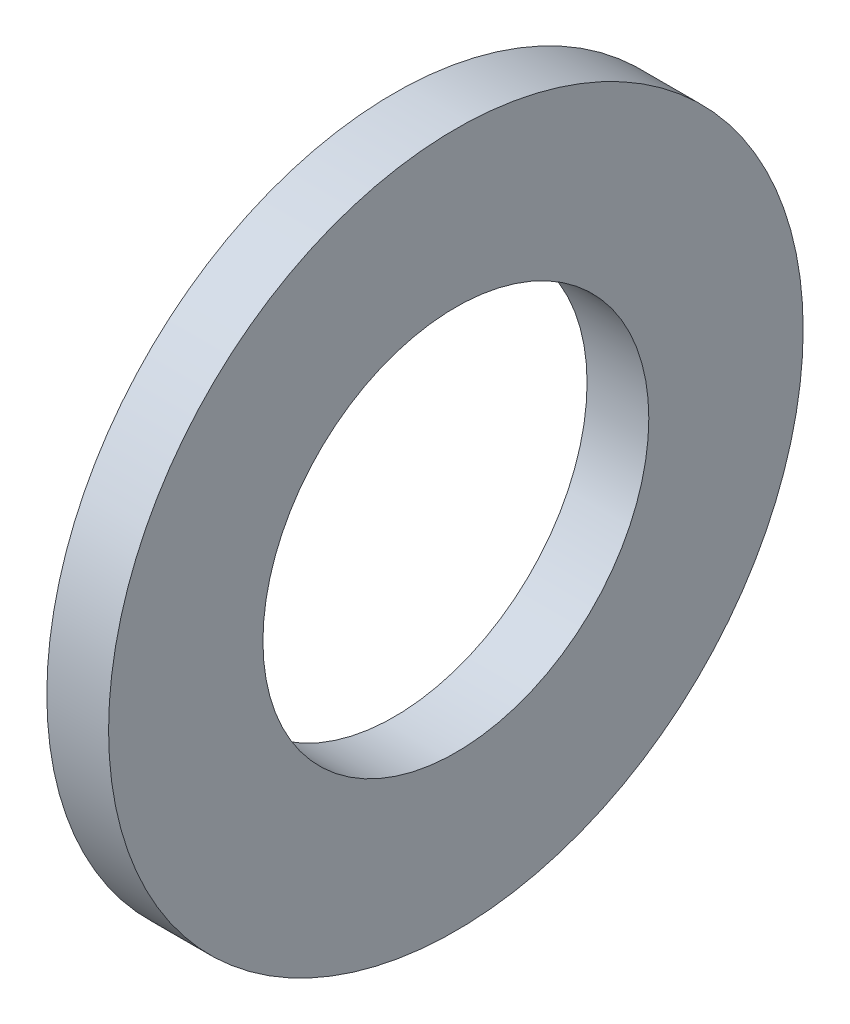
ISO-10303-21;
HEADER;
FILE_DESCRIPTION(('STEP AP214'),'2;1');
FILE_NAME('part.step','',(''),(''),'','','');
FILE_SCHEMA(('AUTOMOTIVE_DESIGN { 1 0 10303 214 1 1 1 1 }'));
ENDSEC;
DATA;
#1=APPLICATION_CONTEXT('core data for automotive mechanical design processes');
#2=APPLICATION_PROTOCOL_DEFINITION('international standard','automotive_design',2000,#1);
#3=PRODUCT_CONTEXT('',#1,'mechanical');
#4=PRODUCT('Part','Part','',(#3));
#5=PRODUCT_RELATED_PRODUCT_CATEGORY('part','',(#4));
#6=PRODUCT_DEFINITION_FORMATION('','',#4);
#7=PRODUCT_DEFINITION_CONTEXT('part definition',#1,'design');
#8=PRODUCT_DEFINITION('design','',#6,#7);
#9=PRODUCT_DEFINITION_SHAPE('','',#8);
#10=(LENGTH_UNIT() NAMED_UNIT(*) SI_UNIT(.MILLI.,.METRE.));
#11=(NAMED_UNIT(*) PLANE_ANGLE_UNIT() SI_UNIT($,.RADIAN.));
#12=(NAMED_UNIT(*) SI_UNIT($,.STERADIAN.) SOLID_ANGLE_UNIT());
#13=UNCERTAINTY_MEASURE_WITH_UNIT(LENGTH_MEASURE(1.E-05),#10,'distance_accuracy_value','');
#14=(GEOMETRIC_REPRESENTATION_CONTEXT(3) GLOBAL_UNCERTAINTY_ASSIGNED_CONTEXT((#13)) GLOBAL_UNIT_ASSIGNED_CONTEXT((#10,
#11,#12)) REPRESENTATION_CONTEXT('',''));
#15=CARTESIAN_POINT('',(0.,0.,0.));
#16=DIRECTION('',(0.,0.,1.));
#17=DIRECTION('',(1.,0.,0.));
#18=AXIS2_PLACEMENT_3D('',#15,#16,#17);
#19=CARTESIAN_POINT('',(-3.33066907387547E-13,0.,-22.4999999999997));
#20=DIRECTION('',(1.,0.,0.));
#21=DIRECTION('',(0.,0.,-1.));
#22=AXIS2_PLACEMENT_3D('',#19,#20,#21);
#23=PLANE('',#22);
#24=CARTESIAN_POINT('',(-2.22044604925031E-13,0.,4.44089209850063E-13));
#25=DIRECTION('',(-1.,0.,0.));
#26=DIRECTION('',(0.,0.,1.));
#27=AXIS2_PLACEMENT_3D('',#24,#25,#26);
#28=CIRCLE('',#27,12.5);
#29=CARTESIAN_POINT('',(-2.24820162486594E-13,0.,12.5000000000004));
#30=VERTEX_POINT('',#29);
#31=EDGE_CURVE('E10',#30,#30,#28,.T.);
#32=ORIENTED_EDGE('',*,*,#31,.F.);
#33=EDGE_LOOP('',(#32));
#34=FACE_BOUND('',#33,.T.);
#35=CARTESIAN_POINT('',(-2.22044604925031E-13,0.,4.44089209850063E-13));
#36=DIRECTION('',(-1.,0.,0.));
#37=DIRECTION('',(0.,0.,1.));
#38=AXIS2_PLACEMENT_3D('',#35,#36,#37);
#39=CIRCLE('',#38,22.5);
#40=CARTESIAN_POINT('',(-2.27040608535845E-13,0.,22.5000000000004));
#41=VERTEX_POINT('',#40);
#42=EDGE_CURVE('E47',#41,#41,#39,.T.);
#43=ORIENTED_EDGE('',*,*,#42,.T.);
#44=EDGE_LOOP('',(#43));
#45=FACE_BOUND('',#44,.T.);
#46=ADVANCED_FACE('F32',(#34,#45),#23,.F.);
#47=CARTESIAN_POINT('',(-2.22044604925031E-13,0.,4.44089209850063E-13));
#48=DIRECTION('',(-1.,0.,0.));
#49=DIRECTION('',(0.,0.,1.));
#50=AXIS2_PLACEMENT_3D('',#47,#48,#49);
#51=CYLINDRICAL_SURFACE('',#50,12.5);
#52=CARTESIAN_POINT('',(4.00000000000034,8.32667268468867E-13,2.22044604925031E-13));
#53=DIRECTION('',(-1.,0.,0.));
#54=DIRECTION('',(0.,0.,1.));
#55=AXIS2_PLACEMENT_3D('',#52,#53,#54);
#56=CIRCLE('',#55,12.5);
#57=CARTESIAN_POINT('',(4.00000000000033,8.32667268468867E-13,12.5000000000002));
#58=VERTEX_POINT('',#57);
#59=EDGE_CURVE('E38',#58,#58,#56,.T.);
#60=ORIENTED_EDGE('',*,*,#59,.F.);
#61=EDGE_LOOP('',(#60));
#62=FACE_BOUND('',#61,.T.);
#63=ORIENTED_EDGE('',*,*,#31,.T.);
#64=EDGE_LOOP('',(#63));
#65=FACE_BOUND('',#64,.T.);
#66=ADVANCED_FACE('F67',(#62,#65),#51,.F.);
#67=CARTESIAN_POINT('',(4.00000000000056,0.,-22.4999999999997));
#68=DIRECTION('',(-1.,0.,0.));
#69=DIRECTION('',(0.,0.,1.));
#70=AXIS2_PLACEMENT_3D('',#67,#68,#69);
#71=PLANE('',#70);
#72=CARTESIAN_POINT('',(4.00000000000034,8.32667268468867E-13,2.22044604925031E-13));
#73=DIRECTION('',(-1.,0.,0.));
#74=DIRECTION('',(0.,0.,1.));
#75=AXIS2_PLACEMENT_3D('',#72,#73,#74);
#76=CIRCLE('',#75,22.5);
#77=CARTESIAN_POINT('',(4.00000000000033,8.32667268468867E-13,22.5000000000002));
#78=VERTEX_POINT('',#77);
#79=EDGE_CURVE('E42',#78,#78,#76,.T.);
#80=ORIENTED_EDGE('',*,*,#79,.F.);
#81=EDGE_LOOP('',(#80));
#82=FACE_BOUND('',#81,.T.);
#83=ORIENTED_EDGE('',*,*,#59,.T.);
#84=EDGE_LOOP('',(#83));
#85=FACE_BOUND('',#84,.T.);
#86=ADVANCED_FACE('F62',(#82,#85),#71,.F.);
#87=CARTESIAN_POINT('',(-2.22044604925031E-13,0.,4.44089209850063E-13));
#88=DIRECTION('',(-1.,0.,0.));
#89=DIRECTION('',(0.,0.,1.));
#90=AXIS2_PLACEMENT_3D('',#87,#88,#89);
#91=CYLINDRICAL_SURFACE('',#90,22.5);
#92=ORIENTED_EDGE('',*,*,#42,.F.);
#93=EDGE_LOOP('',(#92));
#94=FACE_BOUND('',#93,.T.);
#95=ORIENTED_EDGE('',*,*,#79,.T.);
#96=EDGE_LOOP('',(#95));
#97=FACE_BOUND('',#96,.T.);
#98=ADVANCED_FACE('F59',(#94,#97),#91,.T.);
#99=CLOSED_SHELL('',(#46,#66,#86,#98));
#100=MANIFOLD_SOLID_BREP('B2',#99);
#101=ADVANCED_BREP_SHAPE_REPRESENTATION('',(#18,#100),#14);
#102=SHAPE_DEFINITION_REPRESENTATION(#9,#101);
ENDSEC;
END-ISO-10303-21;
